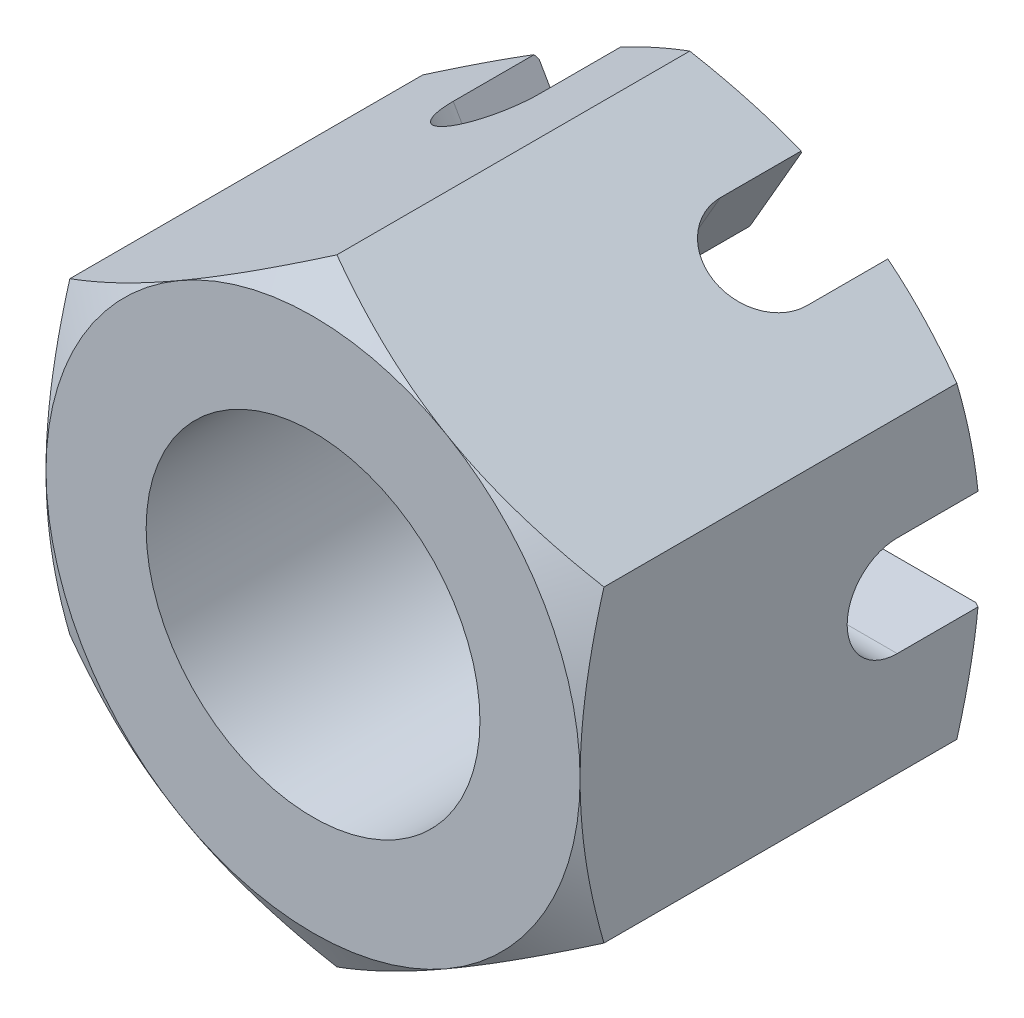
from build123d import *

# Parameters (mm, degrees)
BASE_EXTRUSION_DEPTH         = 12
ESQUISSE3_R                  = 5
ENL_V_MAT_EXTRU_1_DEPTH      = 18.126976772
ENL_V_MAT_EXTRU_2_DEPTH      = 23.030282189
R_P_TITION_CIRCULAIRE1_COUNT = 3


with BuildPart() as part:
    # Esquisse1 → Base-Extrusion (new body)
    with BuildSketch(Plane.XY):
        Polygon((8, -4.618802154), (8, 4.618802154), (0, 9.237604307), (-8, 4.618802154), (-8, -4.618802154), (0, -9.237604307), align=None)
    extrude(amount=-BASE_EXTRUSION_DEPTH)

    # Esquisse2 → Enl_vement de mati_re-R_volution1 (revolve, cut)
    with BuildSketch(Plane(origin=(0, 0, 0), x_dir=(1, 0, 0), z_dir=(0, 1, 0))):
        Polygon((-8, 0), (-19.392304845, 0), (-19.392304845, 12), (-8, 12), (-18.392304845, 6), align=None)
    revolve(axis=Axis((0, 0, -12), (0, 0, 1)), mode=Mode.SUBTRACT)

    # Esquisse3 → Enl_v. mat.-Extru.1 (cut, through all)
    with BuildSketch(Plane.XY):
        Circle(ESQUISSE3_R)
    extrude(amount=-ENL_V_MAT_EXTRU_1_DEPTH, mode=Mode.SUBTRACT)

    # Esquisse4 → Enl_v. mat.-Extru.2 (cut, through all)
    with BuildSketch(Plane(origin=(8, 0, 0), x_dir=(0, 0, -1), z_dir=(1, 0, 0))):
        with BuildLine():
            Line((9.5, 1.5), (12, 1.5))
            Line((12, 1.5), (12, -1.5))
            Line((12, -1.5), (9.5, -1.5))
            ThreePointArc((9.5, -1.5), (8, 0), (9.5, 1.5))
        make_face()
    enl_v_mat_extru_2 = extrude(amount=-ENL_V_MAT_EXTRU_2_DEPTH, mode=Mode.SUBTRACT)

    # R_p_tition circulaire1: Enl_v. mat.-Extru.2 ×3 about axis
    r_p_tition_circulaire1_axis = Axis((0, 0, 0), (0, 0, 1))
    for i in range(1, R_P_TITION_CIRCULAIRE1_COUNT):
        add(enl_v_mat_extru_2.rotate(r_p_tition_circulaire1_axis, i * 360 / R_P_TITION_CIRCULAIRE1_COUNT), mode=Mode.SUBTRACT)


solid = part.part
